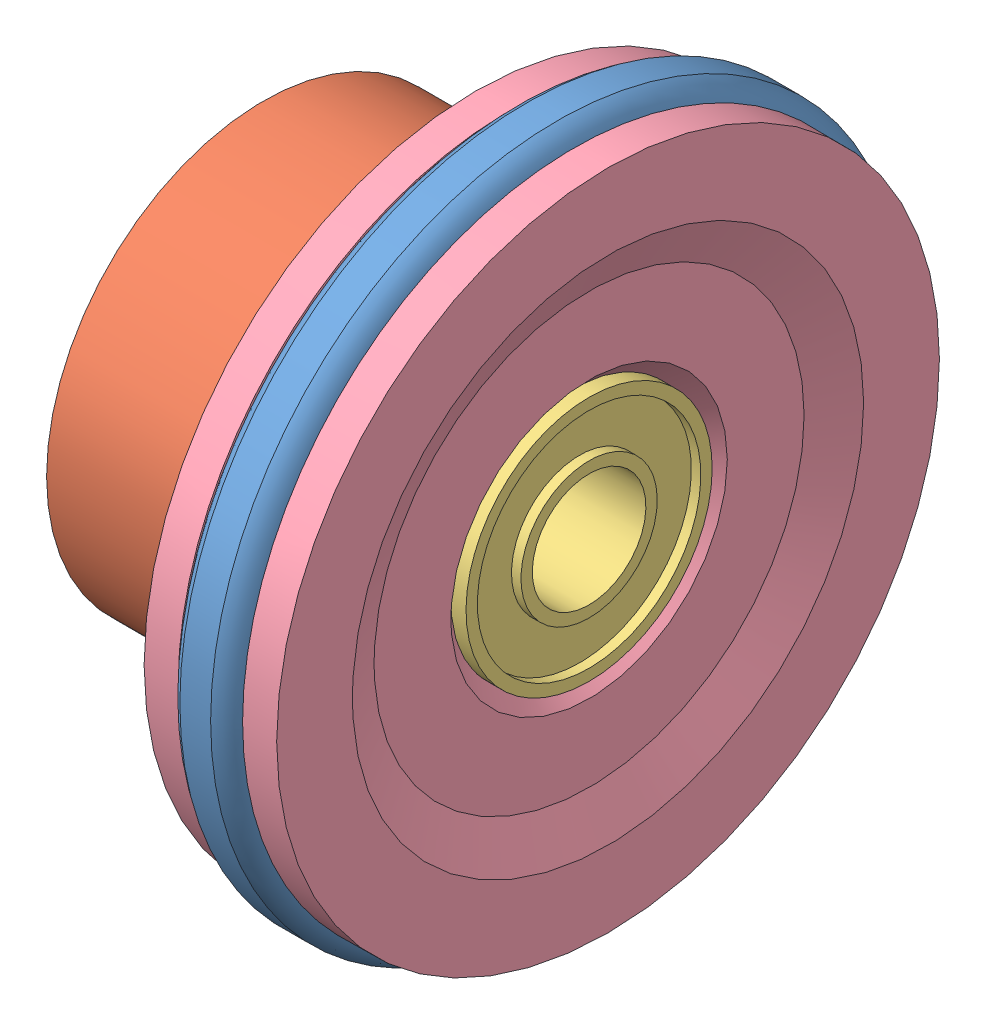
SolidWorks assembly ROUE FOLLE.sldasm, configuration Défaut (file format 9000). Lengths in mm.
Overall size (33.04 36.6 36.6).
5 component instances, 4 part files, 0 mates.
Components (placement in the parent):
- Joint torique 30-3-1: Joint torique 30-3.sldprt [Défaut] at (15.5 0 0) size (3.5 36.6 36.6)
- Joint plat-1: Joint plat.sldprt [Défaut] at (4.75 0 0) size (7.9 22.9 22.9)
- Roulement-6-13-5-ZZ-1: Roulement-6-13-5-ZZ.sldprt [Défaut] at (9.5 0 0) x (0 -0.127939 0.991782) z (-1 0 0) size (13 13 5)
- Roulement-6-13-5-ZZ-2: Roulement-6-13-5-ZZ.sldprt [Défaut] at (13 0 0) x (0 0.740802 -0.671724) z (1 0 0) size (13 13 5)
- roue folle-1: roue folle.sldprt [Défaut] at origin size (19 35 35)
